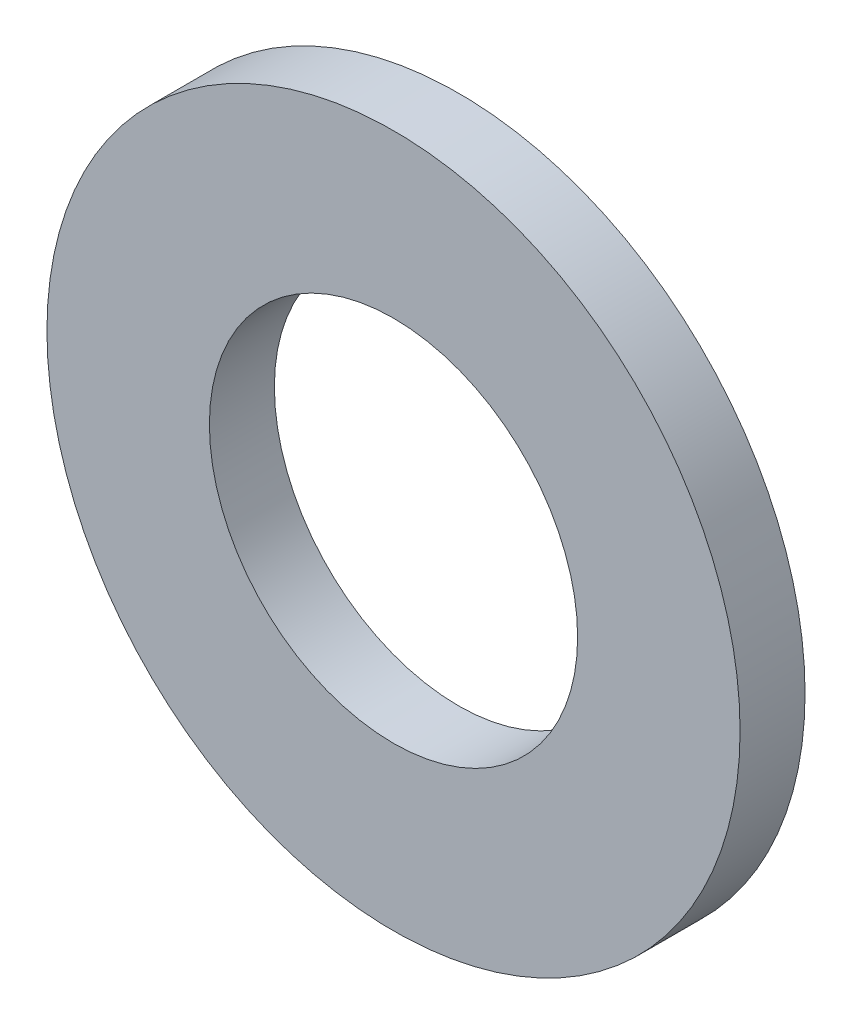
from build123d import *

# Parameters (mm, degrees)
ESQUISSE1_R          = 8
ESQUISSE1_R_2        = 4.25
BASE_EXTRUSION_DEPTH = 1.5


with BuildPart() as part:
    # Esquisse1 → Base-Extrusion (new body)
    with BuildSketch(Plane.XY):
        Circle(ESQUISSE1_R)
        Circle(ESQUISSE1_R_2, mode=Mode.SUBTRACT)
    extrude(amount=-BASE_EXTRUSION_DEPTH)


solid = part.part
